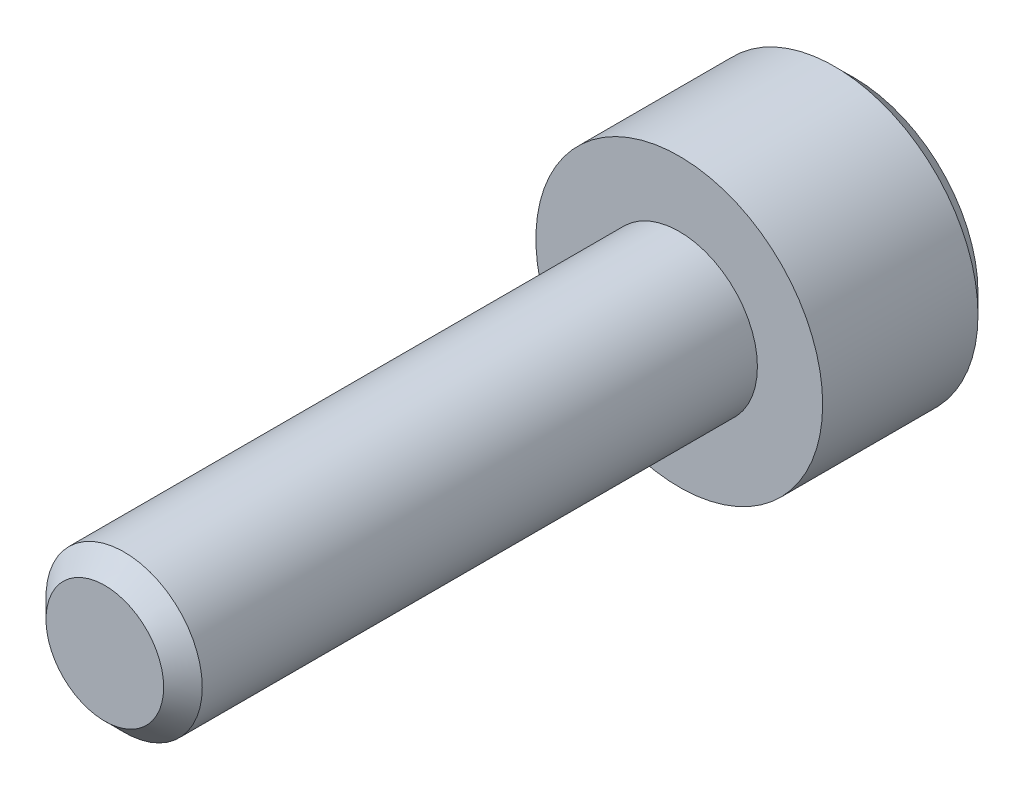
ISO-10303-21;
HEADER;
FILE_DESCRIPTION(('STEP AP214'),'2;1');
FILE_NAME('part.step','',(''),(''),'','','');
FILE_SCHEMA(('AUTOMOTIVE_DESIGN { 1 0 10303 214 1 1 1 1 }'));
ENDSEC;
DATA;
#1=APPLICATION_CONTEXT('core data for automotive mechanical design processes');
#2=APPLICATION_PROTOCOL_DEFINITION('international standard','automotive_design',2000,#1);
#3=PRODUCT_CONTEXT('',#1,'mechanical');
#4=PRODUCT('Part','Part','',(#3));
#5=PRODUCT_RELATED_PRODUCT_CATEGORY('part','',(#4));
#6=PRODUCT_DEFINITION_FORMATION('','',#4);
#7=PRODUCT_DEFINITION_CONTEXT('part definition',#1,'design');
#8=PRODUCT_DEFINITION('design','',#6,#7);
#9=PRODUCT_DEFINITION_SHAPE('','',#8);
#10=(LENGTH_UNIT() NAMED_UNIT(*) SI_UNIT(.MILLI.,.METRE.));
#11=(NAMED_UNIT(*) PLANE_ANGLE_UNIT() SI_UNIT($,.RADIAN.));
#12=(NAMED_UNIT(*) SI_UNIT($,.STERADIAN.) SOLID_ANGLE_UNIT());
#13=UNCERTAINTY_MEASURE_WITH_UNIT(LENGTH_MEASURE(1.E-05),#10,'distance_accuracy_value','');
#14=(GEOMETRIC_REPRESENTATION_CONTEXT(3) GLOBAL_UNCERTAINTY_ASSIGNED_CONTEXT((#13)) GLOBAL_UNIT_ASSIGNED_CONTEXT((#10,
#11,#12)) REPRESENTATION_CONTEXT('',''));
#15=CARTESIAN_POINT('',(0.,0.,0.));
#16=DIRECTION('',(0.,0.,1.));
#17=DIRECTION('',(1.,0.,0.));
#18=AXIS2_PLACEMENT_3D('',#15,#16,#17);
#19=CARTESIAN_POINT('',(0.,0.,15.875));
#20=DIRECTION('',(0.,0.,1.));
#21=DIRECTION('',(1.,0.,0.));
#22=AXIS2_PLACEMENT_3D('',#19,#20,#21);
#23=PLANE('',#22);
#24=CARTESIAN_POINT('',(0.,0.,15.875));
#25=DIRECTION('',(0.,0.,1.));
#26=DIRECTION('',(1.,0.,0.));
#27=AXIS2_PLACEMENT_3D('',#24,#25,#26);
#28=CIRCLE('',#27,1.62560000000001);
#29=CARTESIAN_POINT('',(1.62560000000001,0.,15.875));
#30=VERTEX_POINT('',#29);
#31=EDGE_CURVE('E40',#30,#30,#28,.T.);
#32=ORIENTED_EDGE('',*,*,#31,.T.);
#33=EDGE_LOOP('',(#32));
#34=FACE_BOUND('',#33,.T.);
#35=ADVANCED_FACE('F32',(#34),#23,.T.);
#36=CARTESIAN_POINT('',(3.9624,0.,-4.826));
#37=DIRECTION('',(0.,0.,-1.));
#38=DIRECTION('',(-1.,0.,0.));
#39=AXIS2_PLACEMENT_3D('',#36,#37,#38);
#40=PLANE('',#39);
#41=CARTESIAN_POINT('',(0.,0.,-4.826));
#42=DIRECTION('',(0.,0.,-1.));
#43=DIRECTION('',(-1.,0.,0.));
#44=AXIS2_PLACEMENT_3D('',#41,#42,#43);
#45=CIRCLE('',#44,3.429);
#46=CARTESIAN_POINT('',(-3.42899999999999,0.,-4.826));
#47=VERTEX_POINT('',#46);
#48=EDGE_CURVE('E148',#47,#47,#45,.T.);
#49=ORIENTED_EDGE('',*,*,#48,.T.);
#50=EDGE_LOOP('',(#49));
#51=FACE_BOUND('',#50,.T.);
#52=DIRECTION('',(0.00412520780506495,-0.999991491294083,0.));
#53=VECTOR('',#52,1.);
#54=CARTESIAN_POINT('',(1.97963194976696,1.15385565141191,-4.826));
#55=LINE('',#54,#53);
#56=CARTESIAN_POINT('',(1.97963194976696,1.15385565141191,-4.826));
#57=VERTEX_POINT('',#56);
#58=CARTESIAN_POINT('',(1.98908428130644,-1.13748373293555,-4.826));
#59=VERTEX_POINT('',#58);
#60=EDGE_CURVE('E47',#57,#59,#55,.T.);
#61=ORIENTED_EDGE('',*,*,#60,.F.);
#62=DIRECTION('',(0.868080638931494,-0.496423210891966,0.));
#63=VECTOR('',#62,1.);
#64=CARTESIAN_POINT('',(-0.00945233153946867,2.29133938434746,-4.826));
#65=LINE('',#64,#63);
#66=CARTESIAN_POINT('',(-0.00945233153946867,2.29133938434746,-4.826));
#67=VERTEX_POINT('',#66);
#68=EDGE_CURVE('E130',#67,#57,#65,.T.);
#69=ORIENTED_EDGE('',*,*,#68,.F.);
#70=DIRECTION('',(0.863955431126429,0.503568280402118,0.));
#71=VECTOR('',#70,1.);
#72=CARTESIAN_POINT('',(-1.98908428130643,1.13748373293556,-4.826));
#73=LINE('',#72,#71);
#74=CARTESIAN_POINT('',(-1.98908428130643,1.13748373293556,-4.826));
#75=VERTEX_POINT('',#74);
#76=EDGE_CURVE('E128',#75,#67,#73,.T.);
#77=ORIENTED_EDGE('',*,*,#76,.F.);
#78=DIRECTION('',(-0.00412520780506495,0.999991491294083,0.));
#79=VECTOR('',#78,1.);
#80=CARTESIAN_POINT('',(-1.97963194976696,-1.15385565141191,-4.826));
#81=LINE('',#80,#79);
#82=CARTESIAN_POINT('',(-1.97963194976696,-1.15385565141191,-4.826));
#83=VERTEX_POINT('',#82);
#84=EDGE_CURVE('E95',#83,#75,#81,.T.);
#85=ORIENTED_EDGE('',*,*,#84,.F.);
#86=DIRECTION('',(-0.868080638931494,0.496423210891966,0.));
#87=VECTOR('',#86,1.);
#88=CARTESIAN_POINT('',(0.00945233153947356,-2.29133938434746,-4.826));
#89=LINE('',#88,#87);
#90=CARTESIAN_POINT('',(0.00945233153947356,-2.29133938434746,-4.826));
#91=VERTEX_POINT('',#90);
#92=EDGE_CURVE('E124',#91,#83,#89,.T.);
#93=ORIENTED_EDGE('',*,*,#92,.F.);
#94=DIRECTION('',(-0.863955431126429,-0.503568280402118,0.));
#95=VECTOR('',#94,1.);
#96=CARTESIAN_POINT('',(1.98908428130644,-1.13748373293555,-4.826));
#97=LINE('',#96,#95);
#98=EDGE_CURVE('E121',#59,#91,#97,.T.);
#99=ORIENTED_EDGE('',*,*,#98,.F.);
#100=EDGE_LOOP('',(#61,#69,#77,#85,#93,#99));
#101=FACE_BOUND('',#100,.T.);
#102=ADVANCED_FACE('F163',(#51,#101),#40,.T.);
#103=CARTESIAN_POINT('',(0.,0.,15.875));
#104=DIRECTION('',(0.,0.,1.));
#105=DIRECTION('',(1.,0.,0.));
#106=AXIS2_PLACEMENT_3D('',#103,#104,#105);
#107=CYLINDRICAL_SURFACE('',#106,3.9624);
#108=CARTESIAN_POINT('',(0.,0.,-4.29259999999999));
#109=DIRECTION('',(0.,0.,-1.));
#110=DIRECTION('',(-1.,0.,0.));
#111=AXIS2_PLACEMENT_3D('',#108,#109,#110);
#112=CIRCLE('',#111,3.9624);
#113=CARTESIAN_POINT('',(-3.9624,0.,-4.29259999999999));
#114=VERTEX_POINT('',#113);
#115=EDGE_CURVE('E145',#114,#114,#112,.F.);
#116=ORIENTED_EDGE('',*,*,#115,.T.);
#117=EDGE_LOOP('',(#116));
#118=FACE_BOUND('',#117,.T.);
#119=CARTESIAN_POINT('',(0.,0.,0.));
#120=DIRECTION('',(0.,0.,1.));
#121=DIRECTION('',(1.,0.,0.));
#122=AXIS2_PLACEMENT_3D('',#119,#120,#121);
#123=CIRCLE('',#122,3.9624);
#124=CARTESIAN_POINT('',(3.9624,0.,0.));
#125=VERTEX_POINT('',#124);
#126=EDGE_CURVE('E142',#125,#125,#123,.T.);
#127=ORIENTED_EDGE('',*,*,#126,.F.);
#128=EDGE_LOOP('',(#127));
#129=FACE_BOUND('',#128,.T.);
#130=ADVANCED_FACE('F168',(#118,#129),#107,.T.);
#131=CARTESIAN_POINT('',(2.159,0.,0.));
#132=DIRECTION('',(0.,0.,1.));
#133=DIRECTION('',(1.,0.,0.));
#134=AXIS2_PLACEMENT_3D('',#131,#132,#133);
#135=PLANE('',#134);
#136=ORIENTED_EDGE('',*,*,#126,.T.);
#137=EDGE_LOOP('',(#136));
#138=FACE_BOUND('',#137,.T.);
#139=CARTESIAN_POINT('',(0.,0.,0.));
#140=DIRECTION('',(0.,0.,1.));
#141=DIRECTION('',(1.,0.,0.));
#142=AXIS2_PLACEMENT_3D('',#139,#140,#141);
#143=CIRCLE('',#142,2.159);
#144=CARTESIAN_POINT('',(2.159,0.,0.));
#145=VERTEX_POINT('',#144);
#146=EDGE_CURVE('E134',#145,#145,#143,.T.);
#147=ORIENTED_EDGE('',*,*,#146,.F.);
#148=EDGE_LOOP('',(#147));
#149=FACE_BOUND('',#148,.T.);
#150=ADVANCED_FACE('F174',(#138,#149),#135,.T.);
#151=CARTESIAN_POINT('',(0.,0.,15.875));
#152=DIRECTION('',(0.,0.,1.));
#153=DIRECTION('',(1.,0.,0.));
#154=AXIS2_PLACEMENT_3D('',#151,#152,#153);
#155=CYLINDRICAL_SURFACE('',#154,2.15900000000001);
#156=CARTESIAN_POINT('',(0.,0.,15.3416));
#157=DIRECTION('',(0.,0.,1.));
#158=DIRECTION('',(1.,0.,0.));
#159=AXIS2_PLACEMENT_3D('',#156,#157,#158);
#160=CIRCLE('',#159,2.15900000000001);
#161=CARTESIAN_POINT('',(2.159,0.,15.3416));
#162=VERTEX_POINT('',#161);
#163=EDGE_CURVE('E11',#162,#162,#160,.F.);
#164=ORIENTED_EDGE('',*,*,#163,.T.);
#165=EDGE_LOOP('',(#164));
#166=FACE_BOUND('',#165,.T.);
#167=ORIENTED_EDGE('',*,*,#146,.T.);
#168=EDGE_LOOP('',(#167));
#169=FACE_BOUND('',#168,.T.);
#170=ADVANCED_FACE('F178',(#166,#169),#155,.T.);
#171=CARTESIAN_POINT('',(1.97963194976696,1.15385565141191,-0.126999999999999));
#172=DIRECTION('',(0.999991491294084,0.00412520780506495,0.));
#173=DIRECTION('',(-0.00412520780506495,0.999991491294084,0.));
#174=AXIS2_PLACEMENT_3D('',#171,#172,#173);
#175=PLANE('',#174);
#176=ORIENTED_EDGE('',*,*,#60,.T.);
#177=DIRECTION('',(0.,0.,-1.));
#178=VECTOR('',#177,1.);
#179=CARTESIAN_POINT('',(1.98908428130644,-1.13748373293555,-0.126999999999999));
#180=LINE('',#179,#178);
#181=CARTESIAN_POINT('',(1.98908428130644,-1.13748373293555,-0.126999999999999));
#182=VERTEX_POINT('',#181);
#183=EDGE_CURVE('E77',#182,#59,#180,.T.);
#184=ORIENTED_EDGE('',*,*,#183,.F.);
#185=DIRECTION('',(0.00412520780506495,-0.999991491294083,0.));
#186=VECTOR('',#185,1.);
#187=CARTESIAN_POINT('',(1.97963194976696,1.15385565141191,-0.126999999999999));
#188=LINE('',#187,#186);
#189=CARTESIAN_POINT('',(1.97963194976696,1.15385565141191,-0.126999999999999));
#190=VERTEX_POINT('',#189);
#191=EDGE_CURVE('E132',#190,#182,#188,.T.);
#192=ORIENTED_EDGE('',*,*,#191,.F.);
#193=DIRECTION('',(0.,0.,-1.));
#194=VECTOR('',#193,1.);
#195=CARTESIAN_POINT('',(1.97963194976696,1.15385565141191,-0.126999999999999));
#196=LINE('',#195,#194);
#197=EDGE_CURVE('E55',#190,#57,#196,.T.);
#198=ORIENTED_EDGE('',*,*,#197,.T.);
#199=EDGE_LOOP('',(#176,#184,#192,#198));
#200=FACE_BOUND('',#199,.T.);
#201=ADVANCED_FACE('F182',(#200),#175,.F.);
#202=CARTESIAN_POINT('',(-0.00945233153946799,2.29133938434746,-0.126999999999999));
#203=DIRECTION('',(0.496423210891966,0.868080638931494,0.));
#204=DIRECTION('',(-0.868080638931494,0.496423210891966,0.));
#205=AXIS2_PLACEMENT_3D('',#202,#203,#204);
#206=PLANE('',#205);
#207=ORIENTED_EDGE('',*,*,#68,.T.);
#208=ORIENTED_EDGE('',*,*,#197,.F.);
#209=DIRECTION('',(0.868080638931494,-0.496423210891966,0.));
#210=VECTOR('',#209,1.);
#211=CARTESIAN_POINT('',(-0.00945233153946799,2.29133938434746,-0.126999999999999));
#212=LINE('',#211,#210);
#213=CARTESIAN_POINT('',(-0.00945233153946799,2.29133938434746,-0.126999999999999));
#214=VERTEX_POINT('',#213);
#215=EDGE_CURVE('E107',#214,#190,#212,.T.);
#216=ORIENTED_EDGE('',*,*,#215,.F.);
#217=DIRECTION('',(0.,0.,-1.));
#218=VECTOR('',#217,1.);
#219=CARTESIAN_POINT('',(-0.00945233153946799,2.29133938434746,-0.126999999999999));
#220=LINE('',#219,#218);
#221=EDGE_CURVE('E99',#214,#67,#220,.T.);
#222=ORIENTED_EDGE('',*,*,#221,.T.);
#223=EDGE_LOOP('',(#207,#208,#216,#222));
#224=FACE_BOUND('',#223,.T.);
#225=ADVANCED_FACE('F186',(#224),#206,.F.);
#226=CARTESIAN_POINT('',(-1.98908428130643,1.13748373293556,-0.126999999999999));
#227=DIRECTION('',(-0.503568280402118,0.863955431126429,0.));
#228=DIRECTION('',(-0.863955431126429,-0.503568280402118,0.));
#229=AXIS2_PLACEMENT_3D('',#226,#227,#228);
#230=PLANE('',#229);
#231=ORIENTED_EDGE('',*,*,#76,.T.);
#232=ORIENTED_EDGE('',*,*,#221,.F.);
#233=DIRECTION('',(0.863955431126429,0.503568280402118,0.));
#234=VECTOR('',#233,1.);
#235=CARTESIAN_POINT('',(-1.98908428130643,1.13748373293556,-0.126999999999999));
#236=LINE('',#235,#234);
#237=CARTESIAN_POINT('',(-1.98908428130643,1.13748373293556,-0.126999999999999));
#238=VERTEX_POINT('',#237);
#239=EDGE_CURVE('E103',#238,#214,#236,.T.);
#240=ORIENTED_EDGE('',*,*,#239,.F.);
#241=DIRECTION('',(0.,0.,-1.));
#242=VECTOR('',#241,1.);
#243=CARTESIAN_POINT('',(-1.98908428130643,1.13748373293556,-0.126999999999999));
#244=LINE('',#243,#242);
#245=EDGE_CURVE('E88',#238,#75,#244,.T.);
#246=ORIENTED_EDGE('',*,*,#245,.T.);
#247=EDGE_LOOP('',(#231,#232,#240,#246));
#248=FACE_BOUND('',#247,.T.);
#249=ADVANCED_FACE('F104',(#248),#230,.F.);
#250=CARTESIAN_POINT('',(-1.97963194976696,-1.15385565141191,-0.126999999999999));
#251=DIRECTION('',(-0.999991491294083,-0.00412520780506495,0.));
#252=DIRECTION('',(0.00412520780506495,-0.999991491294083,0.));
#253=AXIS2_PLACEMENT_3D('',#250,#251,#252);
#254=PLANE('',#253);
#255=ORIENTED_EDGE('',*,*,#84,.T.);
#256=ORIENTED_EDGE('',*,*,#245,.F.);
#257=DIRECTION('',(-0.00412520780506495,0.999991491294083,0.));
#258=VECTOR('',#257,1.);
#259=CARTESIAN_POINT('',(-1.97963194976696,-1.15385565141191,-0.126999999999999));
#260=LINE('',#259,#258);
#261=CARTESIAN_POINT('',(-1.97963194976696,-1.15385565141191,-0.126999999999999));
#262=VERTEX_POINT('',#261);
#263=EDGE_CURVE('E92',#262,#238,#260,.T.);
#264=ORIENTED_EDGE('',*,*,#263,.F.);
#265=DIRECTION('',(0.,0.,-1.));
#266=VECTOR('',#265,1.);
#267=CARTESIAN_POINT('',(-1.97963194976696,-1.15385565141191,-0.126999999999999));
#268=LINE('',#267,#266);
#269=EDGE_CURVE('E100',#262,#83,#268,.T.);
#270=ORIENTED_EDGE('',*,*,#269,.T.);
#271=EDGE_LOOP('',(#255,#256,#264,#270));
#272=FACE_BOUND('',#271,.T.);
#273=ADVANCED_FACE('F90',(#272),#254,.F.);
#274=CARTESIAN_POINT('',(0.00945233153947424,-2.29133938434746,-0.126999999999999));
#275=DIRECTION('',(-0.496423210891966,-0.868080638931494,0.));
#276=DIRECTION('',(0.868080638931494,-0.496423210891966,0.));
#277=AXIS2_PLACEMENT_3D('',#274,#275,#276);
#278=PLANE('',#277);
#279=ORIENTED_EDGE('',*,*,#92,.T.);
#280=ORIENTED_EDGE('',*,*,#269,.F.);
#281=DIRECTION('',(-0.868080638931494,0.496423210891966,0.));
#282=VECTOR('',#281,1.);
#283=CARTESIAN_POINT('',(0.00945233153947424,-2.29133938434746,-0.126999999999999));
#284=LINE('',#283,#282);
#285=CARTESIAN_POINT('',(0.00945233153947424,-2.29133938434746,-0.126999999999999));
#286=VERTEX_POINT('',#285);
#287=EDGE_CURVE('E113',#286,#262,#284,.T.);
#288=ORIENTED_EDGE('',*,*,#287,.F.);
#289=DIRECTION('',(0.,0.,-1.));
#290=VECTOR('',#289,1.);
#291=CARTESIAN_POINT('',(0.00945233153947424,-2.29133938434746,-0.126999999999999));
#292=LINE('',#291,#290);
#293=EDGE_CURVE('E137',#286,#91,#292,.T.);
#294=ORIENTED_EDGE('',*,*,#293,.T.);
#295=EDGE_LOOP('',(#279,#280,#288,#294));
#296=FACE_BOUND('',#295,.T.);
#297=ADVANCED_FACE('F190',(#296),#278,.F.);
#298=CARTESIAN_POINT('',(1.98908428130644,-1.13748373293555,-0.126999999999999));
#299=DIRECTION('',(0.503568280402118,-0.863955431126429,0.));
#300=DIRECTION('',(0.863955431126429,0.503568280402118,0.));
#301=AXIS2_PLACEMENT_3D('',#298,#299,#300);
#302=PLANE('',#301);
#303=ORIENTED_EDGE('',*,*,#98,.T.);
#304=ORIENTED_EDGE('',*,*,#293,.F.);
#305=DIRECTION('',(-0.863955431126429,-0.503568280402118,0.));
#306=VECTOR('',#305,1.);
#307=CARTESIAN_POINT('',(1.98908428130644,-1.13748373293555,-0.126999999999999));
#308=LINE('',#307,#306);
#309=EDGE_CURVE('E115',#182,#286,#308,.T.);
#310=ORIENTED_EDGE('',*,*,#309,.F.);
#311=ORIENTED_EDGE('',*,*,#183,.T.);
#312=EDGE_LOOP('',(#303,#304,#310,#311));
#313=FACE_BOUND('',#312,.T.);
#314=ADVANCED_FACE('F187',(#313),#302,.F.);
#315=CARTESIAN_POINT('',(1.98908428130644,-1.13748373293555,-0.126999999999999));
#316=DIRECTION('',(0.,0.,-1.));
#317=DIRECTION('',(-1.,0.,0.));
#318=AXIS2_PLACEMENT_3D('',#315,#316,#317);
#319=PLANE('',#318);
#320=ORIENTED_EDGE('',*,*,#191,.T.);
#321=ORIENTED_EDGE('',*,*,#309,.T.);
#322=ORIENTED_EDGE('',*,*,#287,.T.);
#323=ORIENTED_EDGE('',*,*,#263,.T.);
#324=ORIENTED_EDGE('',*,*,#239,.T.);
#325=ORIENTED_EDGE('',*,*,#215,.T.);
#326=EDGE_LOOP('',(#320,#321,#322,#323,#324,#325));
#327=FACE_BOUND('',#326,.T.);
#328=ADVANCED_FACE('F110',(#327),#319,.T.);
#329=CARTESIAN_POINT('',(0.,0.,-4.2926));
#330=DIRECTION('',(0.,0.,1.));
#331=DIRECTION('',(1.,0.,0.));
#332=AXIS2_PLACEMENT_3D('',#329,#330,#331);
#333=CONICAL_SURFACE('',#332,3.9624,0.785398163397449);
#334=ORIENTED_EDGE('',*,*,#48,.F.);
#335=EDGE_LOOP('',(#334));
#336=FACE_BOUND('',#335,.T.);
#337=ORIENTED_EDGE('',*,*,#115,.F.);
#338=EDGE_LOOP('',(#337));
#339=FACE_BOUND('',#338,.T.);
#340=ADVANCED_FACE('F155',(#336,#339),#333,.T.);
#341=CARTESIAN_POINT('',(0.,0.,15.875));
#342=DIRECTION('',(0.,0.,-1.));
#343=DIRECTION('',(-1.,0.,0.));
#344=AXIS2_PLACEMENT_3D('',#341,#342,#343);
#345=CONICAL_SURFACE('',#344,1.62560000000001,0.785398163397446);
#346=ORIENTED_EDGE('',*,*,#163,.F.);
#347=EDGE_LOOP('',(#346));
#348=FACE_BOUND('',#347,.T.);
#349=ORIENTED_EDGE('',*,*,#31,.F.);
#350=EDGE_LOOP('',(#349));
#351=FACE_BOUND('',#350,.T.);
#352=ADVANCED_FACE('F34',(#348,#351),#345,.T.);
#353=CLOSED_SHELL('',(#35,#102,#130,#150,#170,#201,#225,#249,#273,#297,#314,#328,#340,#352));
#354=MANIFOLD_SOLID_BREP('B2',#353);
#355=ADVANCED_BREP_SHAPE_REPRESENTATION('',(#18,#354),#14);
#356=SHAPE_DEFINITION_REPRESENTATION(#9,#355);
ENDSEC;
END-ISO-10303-21;
